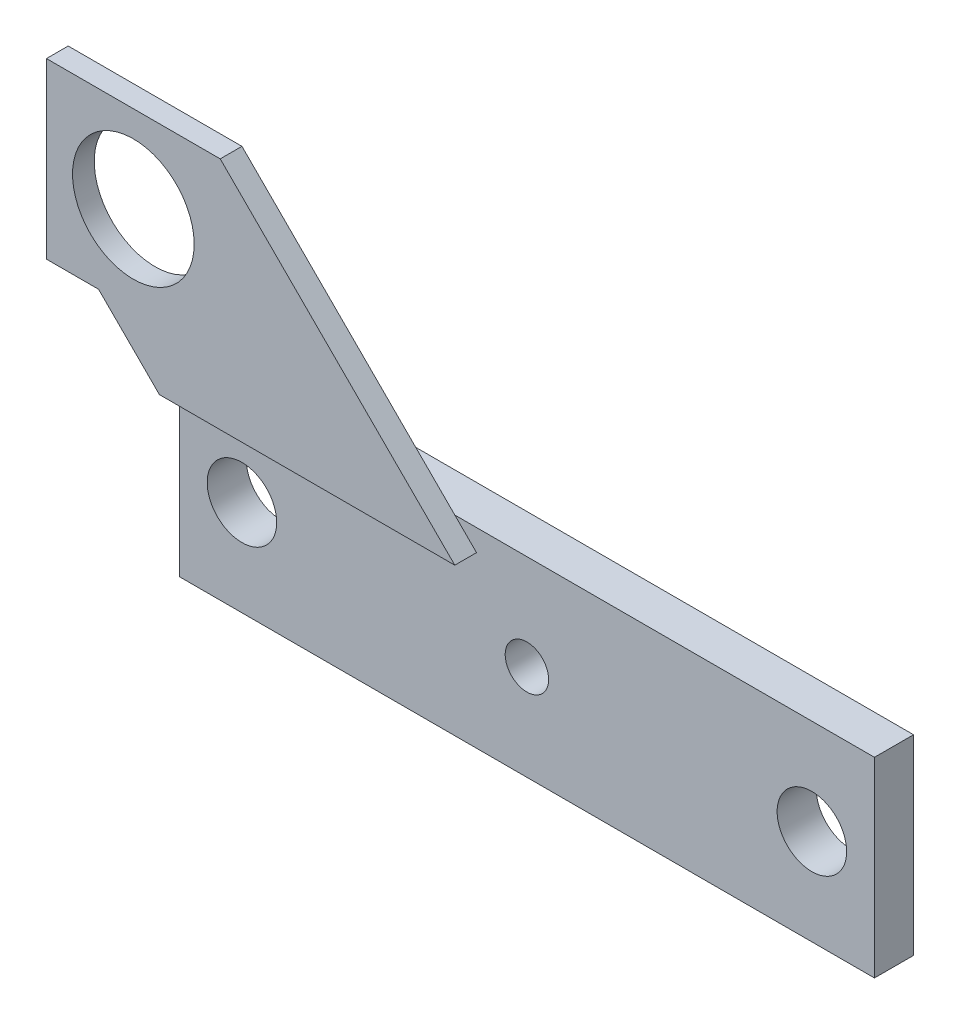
ISO-10303-21;
HEADER;
FILE_DESCRIPTION(('STEP AP214'),'2;1');
FILE_NAME('part.step','',(''),(''),'','','');
FILE_SCHEMA(('AUTOMOTIVE_DESIGN { 1 0 10303 214 1 1 1 1 }'));
ENDSEC;
DATA;
#1=APPLICATION_CONTEXT('core data for automotive mechanical design processes');
#2=APPLICATION_PROTOCOL_DEFINITION('international standard','automotive_design',2000,#1);
#3=PRODUCT_CONTEXT('',#1,'mechanical');
#4=PRODUCT('Part','Part','',(#3));
#5=PRODUCT_RELATED_PRODUCT_CATEGORY('part','',(#4));
#6=PRODUCT_DEFINITION_FORMATION('','',#4);
#7=PRODUCT_DEFINITION_CONTEXT('part definition',#1,'design');
#8=PRODUCT_DEFINITION('design','',#6,#7);
#9=PRODUCT_DEFINITION_SHAPE('','',#8);
#10=(LENGTH_UNIT() NAMED_UNIT(*) SI_UNIT(.MILLI.,.METRE.));
#11=(NAMED_UNIT(*) PLANE_ANGLE_UNIT() SI_UNIT($,.RADIAN.));
#12=(NAMED_UNIT(*) SI_UNIT($,.STERADIAN.) SOLID_ANGLE_UNIT());
#13=UNCERTAINTY_MEASURE_WITH_UNIT(LENGTH_MEASURE(1.E-05),#10,'distance_accuracy_value','');
#14=(GEOMETRIC_REPRESENTATION_CONTEXT(3) GLOBAL_UNCERTAINTY_ASSIGNED_CONTEXT((#13)) GLOBAL_UNIT_ASSIGNED_CONTEXT((#10,
#11,#12)) REPRESENTATION_CONTEXT('',''));
#15=CARTESIAN_POINT('',(0.,0.,0.));
#16=DIRECTION('',(0.,0.,1.));
#17=DIRECTION('',(1.,0.,0.));
#18=AXIS2_PLACEMENT_3D('',#15,#16,#17);
#19=CARTESIAN_POINT('',(21.3892111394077,-12.75,-2.25));
#20=DIRECTION('',(0.,0.,-1.));
#21=DIRECTION('',(-0.201287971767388,-0.979532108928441,0.));
#22=AXIS2_PLACEMENT_3D('',#19,#20,#21);
#23=PLANE('',#22);
#24=DIRECTION('',(-1.,0.,0.));
#25=VECTOR('',#24,1.);
#26=CARTESIAN_POINT('',(1.40000000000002,-18.25,-2.25));
#27=LINE('',#26,#25);
#28=CARTESIAN_POINT('',(41.4,-18.25,-2.25000000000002));
#29=VERTEX_POINT('',#28);
#30=CARTESIAN_POINT('',(1.40000000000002,-18.25,-2.25));
#31=VERTEX_POINT('',#30);
#32=EDGE_CURVE('E119',#29,#31,#27,.T.);
#33=ORIENTED_EDGE('',*,*,#32,.T.);
#34=DIRECTION('',(0.,1.,0.));
#35=VECTOR('',#34,1.);
#36=CARTESIAN_POINT('',(1.40000000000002,-7.24999999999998,-2.25));
#37=LINE('',#36,#35);
#38=CARTESIAN_POINT('',(1.40000000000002,-7.24999999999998,-2.25000000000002));
#39=VERTEX_POINT('',#38);
#40=EDGE_CURVE('E130',#31,#39,#37,.T.);
#41=ORIENTED_EDGE('',*,*,#40,.T.);
#42=DIRECTION('',(1.,0.,0.));
#43=VECTOR('',#42,1.);
#44=CARTESIAN_POINT('',(1.40000000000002,-7.24999999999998,-2.25));
#45=LINE('',#44,#43);
#46=CARTESIAN_POINT('',(41.4,-7.24999999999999,-2.25000000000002));
#47=VERTEX_POINT('',#46);
#48=EDGE_CURVE('E137',#39,#47,#45,.T.);
#49=ORIENTED_EDGE('',*,*,#48,.T.);
#50=DIRECTION('',(0.,-1.,0.));
#51=VECTOR('',#50,1.);
#52=CARTESIAN_POINT('',(41.4,-7.24999999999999,-2.25));
#53=LINE('',#52,#51);
#54=EDGE_CURVE('E140',#47,#29,#53,.T.);
#55=ORIENTED_EDGE('',*,*,#54,.T.);
#56=EDGE_LOOP('',(#33,#41,#49,#55));
#57=FACE_BOUND('',#56,.T.);
#58=CARTESIAN_POINT('',(5.00000000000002,-12.75,-2.25));
#59=DIRECTION('',(0.,0.,-1.));
#60=DIRECTION('',(-1.,0.,0.));
#61=AXIS2_PLACEMENT_3D('',#58,#59,#60);
#62=CIRCLE('',#61,2.);
#63=CARTESIAN_POINT('',(7.00000000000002,-12.75,-2.25000000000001));
#64=VERTEX_POINT('',#63);
#65=EDGE_CURVE('E141',#64,#64,#62,.T.);
#66=ORIENTED_EDGE('',*,*,#65,.F.);
#67=EDGE_LOOP('',(#66));
#68=FACE_BOUND('',#67,.T.);
#69=CARTESIAN_POINT('',(37.8,-12.75,-2.25));
#70=DIRECTION('',(0.,0.,-1.));
#71=DIRECTION('',(-1.,0.,0.));
#72=AXIS2_PLACEMENT_3D('',#69,#70,#71);
#73=CIRCLE('',#72,2.);
#74=CARTESIAN_POINT('',(39.8,-12.75,-2.25000000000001));
#75=VERTEX_POINT('',#74);
#76=EDGE_CURVE('E145',#75,#75,#73,.T.);
#77=ORIENTED_EDGE('',*,*,#76,.F.);
#78=EDGE_LOOP('',(#77));
#79=FACE_BOUND('',#78,.T.);
#80=CARTESIAN_POINT('',(21.4,-12.75,-2.25));
#81=DIRECTION('',(0.,0.,-1.));
#82=DIRECTION('',(-1.,0.,0.));
#83=AXIS2_PLACEMENT_3D('',#80,#81,#82);
#84=CIRCLE('',#83,3.25000000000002);
#85=CARTESIAN_POINT('',(18.15,-12.75,-2.25));
#86=VERTEX_POINT('',#85);
#87=EDGE_CURVE('E408',#86,#86,#84,.T.);
#88=ORIENTED_EDGE('',*,*,#87,.F.);
#89=EDGE_LOOP('',(#88));
#90=FACE_BOUND('',#89,.T.);
#91=ADVANCED_FACE('F32',(#57,#68,#79,#90),#23,.T.);
#92=CARTESIAN_POINT('',(-5.,-5.,1.25));
#93=DIRECTION('',(0.,0.,-1.));
#94=DIRECTION('',(-1.,0.,0.));
#95=AXIS2_PLACEMENT_3D('',#92,#93,#94);
#96=PLANE('',#95);
#97=DIRECTION('',(0.,-1.,0.));
#98=VECTOR('',#97,1.);
#99=CARTESIAN_POINT('',(-5.,5.,1.25));
#100=LINE('',#99,#98);
#101=CARTESIAN_POINT('',(-5.,5.,1.25));
#102=VERTEX_POINT('',#101);
#103=CARTESIAN_POINT('',(-5.,-5.,1.25));
#104=VERTEX_POINT('',#103);
#105=EDGE_CURVE('E179',#102,#104,#100,.T.);
#106=ORIENTED_EDGE('',*,*,#105,.T.);
#107=DIRECTION('',(1.,0.,0.));
#108=VECTOR('',#107,1.);
#109=CARTESIAN_POINT('',(-1.9999999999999,-5.,1.25));
#110=LINE('',#109,#108);
#111=CARTESIAN_POINT('',(-1.9999999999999,-5.,1.25));
#112=VERTEX_POINT('',#111);
#113=EDGE_CURVE('E182',#104,#112,#110,.T.);
#114=ORIENTED_EDGE('',*,*,#113,.T.);
#115=DIRECTION('',(0.707106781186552,-0.707106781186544,0.));
#116=VECTOR('',#115,1.);
#117=CARTESIAN_POINT('',(1.50000000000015,-8.5,1.25));
#118=LINE('',#117,#116);
#119=CARTESIAN_POINT('',(1.50000000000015,-8.5,1.25));
#120=VERTEX_POINT('',#119);
#121=EDGE_CURVE('E185',#112,#120,#118,.T.);
#122=ORIENTED_EDGE('',*,*,#121,.T.);
#123=DIRECTION('',(1.,0.,0.));
#124=VECTOR('',#123,1.);
#125=CARTESIAN_POINT('',(18.5000000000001,-8.5,1.25));
#126=LINE('',#125,#124);
#127=CARTESIAN_POINT('',(18.5000000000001,-8.5,1.25));
#128=VERTEX_POINT('',#127);
#129=EDGE_CURVE('E187',#120,#128,#126,.T.);
#130=ORIENTED_EDGE('',*,*,#129,.T.);
#131=DIRECTION('',(-0.707106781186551,0.707106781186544,0.));
#132=VECTOR('',#131,1.);
#133=CARTESIAN_POINT('',(5.,5.,1.25));
#134=LINE('',#133,#132);
#135=CARTESIAN_POINT('',(5.,5.,1.25));
#136=VERTEX_POINT('',#135);
#137=EDGE_CURVE('E189',#128,#136,#134,.T.);
#138=ORIENTED_EDGE('',*,*,#137,.T.);
#139=DIRECTION('',(-1.,0.,0.));
#140=VECTOR('',#139,1.);
#141=CARTESIAN_POINT('',(-5.,5.,1.25));
#142=LINE('',#141,#140);
#143=EDGE_CURVE('E191',#136,#102,#142,.T.);
#144=ORIENTED_EDGE('',*,*,#143,.T.);
#145=EDGE_LOOP('',(#106,#114,#122,#130,#138,#144));
#146=FACE_BOUND('',#145,.T.);
#147=CARTESIAN_POINT('',(0.,0.,1.25));
#148=DIRECTION('',(0.,0.,1.));
#149=DIRECTION('',(1.,0.,0.));
#150=AXIS2_PLACEMENT_3D('',#147,#148,#149);
#151=CIRCLE('',#150,3.5);
#152=CARTESIAN_POINT('',(3.5,0.,1.25));
#153=VERTEX_POINT('',#152);
#154=EDGE_CURVE('E173',#153,#153,#151,.T.);
#155=ORIENTED_EDGE('',*,*,#154,.F.);
#156=EDGE_LOOP('',(#155));
#157=FACE_BOUND('',#156,.T.);
#158=ADVANCED_FACE('F256',(#146,#157),#96,.F.);
#159=CARTESIAN_POINT('',(-5.,-5.,0.));
#160=DIRECTION('',(0.,0.,-1.));
#161=DIRECTION('',(-1.,0.,0.));
#162=AXIS2_PLACEMENT_3D('',#159,#160,#161);
#163=PLANE('',#162);
#164=DIRECTION('',(0.,1.,0.));
#165=VECTOR('',#164,1.);
#166=CARTESIAN_POINT('',(1.40000000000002,-7.24999999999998,0.));
#167=LINE('',#166,#165);
#168=CARTESIAN_POINT('',(1.40000000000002,-8.39999999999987,0.));
#169=VERTEX_POINT('',#168);
#170=CARTESIAN_POINT('',(1.40000000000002,-7.24999999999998,0.));
#171=VERTEX_POINT('',#170);
#172=EDGE_CURVE('E12',#169,#171,#167,.T.);
#173=ORIENTED_EDGE('',*,*,#172,.F.);
#174=DIRECTION('',(0.707106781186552,-0.707106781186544,0.));
#175=VECTOR('',#174,1.);
#176=CARTESIAN_POINT('',(1.50000000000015,-8.5,0.));
#177=LINE('',#176,#175);
#178=CARTESIAN_POINT('',(-1.9999999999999,-5.,0.));
#179=VERTEX_POINT('',#178);
#180=EDGE_CURVE('E199',#179,#169,#177,.T.);
#181=ORIENTED_EDGE('',*,*,#180,.F.);
#182=DIRECTION('',(1.,0.,0.));
#183=VECTOR('',#182,1.);
#184=CARTESIAN_POINT('',(-1.9999999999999,-5.,0.));
#185=LINE('',#184,#183);
#186=CARTESIAN_POINT('',(-5.,-5.,0.));
#187=VERTEX_POINT('',#186);
#188=EDGE_CURVE('E196',#187,#179,#185,.T.);
#189=ORIENTED_EDGE('',*,*,#188,.F.);
#190=DIRECTION('',(0.,-1.,0.));
#191=VECTOR('',#190,1.);
#192=CARTESIAN_POINT('',(-5.,5.,0.));
#193=LINE('',#192,#191);
#194=CARTESIAN_POINT('',(-5.,5.,0.));
#195=VERTEX_POINT('',#194);
#196=EDGE_CURVE('E176',#195,#187,#193,.T.);
#197=ORIENTED_EDGE('',*,*,#196,.F.);
#198=DIRECTION('',(-1.,0.,0.));
#199=VECTOR('',#198,1.);
#200=CARTESIAN_POINT('',(-5.,5.,0.));
#201=LINE('',#200,#199);
#202=CARTESIAN_POINT('',(5.,5.,0.));
#203=VERTEX_POINT('',#202);
#204=EDGE_CURVE('E183',#203,#195,#201,.T.);
#205=ORIENTED_EDGE('',*,*,#204,.F.);
#206=DIRECTION('',(-0.707106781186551,0.707106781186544,0.));
#207=VECTOR('',#206,1.);
#208=CARTESIAN_POINT('',(5.,5.,0.));
#209=LINE('',#208,#207);
#210=CARTESIAN_POINT('',(17.2500000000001,-7.24999999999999,0.));
#211=VERTEX_POINT('',#210);
#212=EDGE_CURVE('E203',#211,#203,#209,.T.);
#213=ORIENTED_EDGE('',*,*,#212,.F.);
#214=DIRECTION('',(1.,0.,0.));
#215=VECTOR('',#214,1.);
#216=CARTESIAN_POINT('',(1.40000000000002,-7.24999999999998,0.));
#217=LINE('',#216,#215);
#218=EDGE_CURVE('E49',#171,#211,#217,.T.);
#219=ORIENTED_EDGE('',*,*,#218,.F.);
#220=EDGE_LOOP('',(#173,#181,#189,#197,#205,#213,#219));
#221=FACE_BOUND('',#220,.T.);
#222=CARTESIAN_POINT('',(0.,0.,0.));
#223=DIRECTION('',(0.,0.,1.));
#224=DIRECTION('',(1.,0.,0.));
#225=AXIS2_PLACEMENT_3D('',#222,#223,#224);
#226=CIRCLE('',#225,3.5);
#227=CARTESIAN_POINT('',(3.5,0.,0.));
#228=VERTEX_POINT('',#227);
#229=EDGE_CURVE('E169',#228,#228,#226,.T.);
#230=ORIENTED_EDGE('',*,*,#229,.T.);
#231=EDGE_LOOP('',(#230));
#232=FACE_BOUND('',#231,.T.);
#233=ADVANCED_FACE('F231',(#221,#232),#163,.T.);
#234=CARTESIAN_POINT('',(-5.,5.,1.25));
#235=DIRECTION('',(1.,0.,0.));
#236=DIRECTION('',(0.,0.,-1.));
#237=AXIS2_PLACEMENT_3D('',#234,#235,#236);
#238=PLANE('',#237);
#239=ORIENTED_EDGE('',*,*,#196,.T.);
#240=DIRECTION('',(0.,0.,-1.));
#241=VECTOR('',#240,1.);
#242=CARTESIAN_POINT('',(-5.,-5.,1.25));
#243=LINE('',#242,#241);
#244=EDGE_CURVE('E36',#104,#187,#243,.T.);
#245=ORIENTED_EDGE('',*,*,#244,.F.);
#246=ORIENTED_EDGE('',*,*,#105,.F.);
#247=DIRECTION('',(0.,0.,-1.));
#248=VECTOR('',#247,1.);
#249=CARTESIAN_POINT('',(-5.,5.,1.25));
#250=LINE('',#249,#248);
#251=EDGE_CURVE('E193',#102,#195,#250,.T.);
#252=ORIENTED_EDGE('',*,*,#251,.T.);
#253=EDGE_LOOP('',(#239,#245,#246,#252));
#254=FACE_BOUND('',#253,.T.);
#255=ADVANCED_FACE('F34',(#254),#238,.F.);
#256=CARTESIAN_POINT('',(-1.9999999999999,-5.,1.25));
#257=DIRECTION('',(0.,1.,0.));
#258=DIRECTION('',(-1.,0.,0.));
#259=AXIS2_PLACEMENT_3D('',#256,#257,#258);
#260=PLANE('',#259);
#261=ORIENTED_EDGE('',*,*,#188,.T.);
#262=DIRECTION('',(0.,0.,-1.));
#263=VECTOR('',#262,1.);
#264=CARTESIAN_POINT('',(-1.9999999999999,-5.,1.25));
#265=LINE('',#264,#263);
#266=EDGE_CURVE('E217',#112,#179,#265,.T.);
#267=ORIENTED_EDGE('',*,*,#266,.F.);
#268=ORIENTED_EDGE('',*,*,#113,.F.);
#269=ORIENTED_EDGE('',*,*,#244,.T.);
#270=EDGE_LOOP('',(#261,#267,#268,#269));
#271=FACE_BOUND('',#270,.T.);
#272=ADVANCED_FACE('F225',(#271),#260,.F.);
#273=CARTESIAN_POINT('',(1.50000000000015,-8.5,1.25));
#274=DIRECTION('',(0.707106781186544,0.707106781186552,0.));
#275=DIRECTION('',(-0.707106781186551,0.707106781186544,0.));
#276=AXIS2_PLACEMENT_3D('',#273,#274,#275);
#277=PLANE('',#276);
#278=ORIENTED_EDGE('',*,*,#180,.T.);
#279=CARTESIAN_POINT('',(1.50000000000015,-8.5,0.));
#280=VERTEX_POINT('',#279);
#281=EDGE_CURVE('E198',#169,#280,#177,.T.);
#282=ORIENTED_EDGE('',*,*,#281,.T.);
#283=DIRECTION('',(0.,0.,-1.));
#284=VECTOR('',#283,1.);
#285=CARTESIAN_POINT('',(1.50000000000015,-8.5,1.25));
#286=LINE('',#285,#284);
#287=EDGE_CURVE('E215',#120,#280,#286,.T.);
#288=ORIENTED_EDGE('',*,*,#287,.F.);
#289=ORIENTED_EDGE('',*,*,#121,.F.);
#290=ORIENTED_EDGE('',*,*,#266,.T.);
#291=EDGE_LOOP('',(#278,#282,#288,#289,#290));
#292=FACE_BOUND('',#291,.T.);
#293=ADVANCED_FACE('F234',(#292),#277,.F.);
#294=CARTESIAN_POINT('',(18.5000000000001,-8.5,1.25));
#295=DIRECTION('',(0.,1.,0.));
#296=DIRECTION('',(-1.,0.,0.));
#297=AXIS2_PLACEMENT_3D('',#294,#295,#296);
#298=PLANE('',#297);
#299=DIRECTION('',(1.,0.,0.));
#300=VECTOR('',#299,1.);
#301=CARTESIAN_POINT('',(18.5000000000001,-8.5,0.));
#302=LINE('',#301,#300);
#303=CARTESIAN_POINT('',(18.5000000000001,-8.5,0.));
#304=VERTEX_POINT('',#303);
#305=EDGE_CURVE('E201',#280,#304,#302,.T.);
#306=ORIENTED_EDGE('',*,*,#305,.T.);
#307=DIRECTION('',(0.,0.,-1.));
#308=VECTOR('',#307,1.);
#309=CARTESIAN_POINT('',(18.5000000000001,-8.5,1.25));
#310=LINE('',#309,#308);
#311=EDGE_CURVE('E212',#128,#304,#310,.T.);
#312=ORIENTED_EDGE('',*,*,#311,.F.);
#313=ORIENTED_EDGE('',*,*,#129,.F.);
#314=ORIENTED_EDGE('',*,*,#287,.T.);
#315=EDGE_LOOP('',(#306,#312,#313,#314));
#316=FACE_BOUND('',#315,.T.);
#317=ADVANCED_FACE('F254',(#316),#298,.F.);
#318=CARTESIAN_POINT('',(5.,5.,1.25));
#319=DIRECTION('',(-0.707106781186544,-0.707106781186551,0.));
#320=DIRECTION('',(0.707106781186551,-0.707106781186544,0.));
#321=AXIS2_PLACEMENT_3D('',#318,#319,#320);
#322=PLANE('',#321);
#323=EDGE_CURVE('E204',#304,#211,#209,.T.);
#324=ORIENTED_EDGE('',*,*,#323,.T.);
#325=ORIENTED_EDGE('',*,*,#212,.T.);
#326=DIRECTION('',(0.,0.,-1.));
#327=VECTOR('',#326,1.);
#328=CARTESIAN_POINT('',(5.,5.,1.25));
#329=LINE('',#328,#327);
#330=EDGE_CURVE('E209',#136,#203,#329,.T.);
#331=ORIENTED_EDGE('',*,*,#330,.F.);
#332=ORIENTED_EDGE('',*,*,#137,.F.);
#333=ORIENTED_EDGE('',*,*,#311,.T.);
#334=EDGE_LOOP('',(#324,#325,#331,#332,#333));
#335=FACE_BOUND('',#334,.T.);
#336=ADVANCED_FACE('F248',(#335),#322,.F.);
#337=CARTESIAN_POINT('',(-5.,5.,1.25));
#338=DIRECTION('',(0.,-1.,0.));
#339=DIRECTION('',(0.,0.,-1.));
#340=AXIS2_PLACEMENT_3D('',#337,#338,#339);
#341=PLANE('',#340);
#342=ORIENTED_EDGE('',*,*,#204,.T.);
#343=ORIENTED_EDGE('',*,*,#251,.F.);
#344=ORIENTED_EDGE('',*,*,#143,.F.);
#345=ORIENTED_EDGE('',*,*,#330,.T.);
#346=EDGE_LOOP('',(#342,#343,#344,#345));
#347=FACE_BOUND('',#346,.T.);
#348=ADVANCED_FACE('F260',(#347),#341,.F.);
#349=CARTESIAN_POINT('',(0.,0.,1.25));
#350=DIRECTION('',(0.,0.,-1.));
#351=DIRECTION('',(-1.,0.,0.));
#352=AXIS2_PLACEMENT_3D('',#349,#350,#351);
#353=CYLINDRICAL_SURFACE('',#352,3.5);
#354=ORIENTED_EDGE('',*,*,#154,.T.);
#355=EDGE_LOOP('',(#354));
#356=FACE_BOUND('',#355,.T.);
#357=ORIENTED_EDGE('',*,*,#229,.F.);
#358=EDGE_LOOP('',(#357));
#359=FACE_BOUND('',#358,.T.);
#360=ADVANCED_FACE('F262',(#356,#359),#353,.F.);
#361=CARTESIAN_POINT('',(1.40000000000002,-18.25,0.));
#362=DIRECTION('',(0.,0.,1.));
#363=DIRECTION('',(1.,0.,0.));
#364=AXIS2_PLACEMENT_3D('',#361,#362,#363);
#365=PLANE('',#364);
#366=CARTESIAN_POINT('',(37.8,-12.75,0.));
#367=DIRECTION('',(0.,0.,-1.));
#368=DIRECTION('',(-1.,0.,0.));
#369=AXIS2_PLACEMENT_3D('',#366,#367,#368);
#370=CIRCLE('',#369,2.);
#371=CARTESIAN_POINT('',(39.8,-12.75,0.));
#372=VERTEX_POINT('',#371);
#373=EDGE_CURVE('E136',#372,#372,#370,.T.);
#374=ORIENTED_EDGE('',*,*,#373,.T.);
#375=EDGE_LOOP('',(#374));
#376=FACE_BOUND('',#375,.T.);
#377=CARTESIAN_POINT('',(21.4,-12.75,0.));
#378=DIRECTION('',(0.,0.,-1.));
#379=DIRECTION('',(-1.,0.,0.));
#380=AXIS2_PLACEMENT_3D('',#377,#378,#379);
#381=CIRCLE('',#380,1.25000000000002);
#382=CARTESIAN_POINT('',(22.65,-12.75,0.));
#383=VERTEX_POINT('',#382);
#384=EDGE_CURVE('E155',#383,#383,#381,.T.);
#385=ORIENTED_EDGE('',*,*,#384,.T.);
#386=EDGE_LOOP('',(#385));
#387=FACE_BOUND('',#386,.T.);
#388=CARTESIAN_POINT('',(5.00000000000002,-12.75,0.));
#389=DIRECTION('',(0.,0.,-1.));
#390=DIRECTION('',(-1.,0.,0.));
#391=AXIS2_PLACEMENT_3D('',#388,#389,#390);
#392=CIRCLE('',#391,2.);
#393=CARTESIAN_POINT('',(7.00000000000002,-12.75,0.));
#394=VERTEX_POINT('',#393);
#395=EDGE_CURVE('E152',#394,#394,#392,.T.);
#396=ORIENTED_EDGE('',*,*,#395,.T.);
#397=EDGE_LOOP('',(#396));
#398=FACE_BOUND('',#397,.T.);
#399=ORIENTED_EDGE('',*,*,#323,.F.);
#400=ORIENTED_EDGE('',*,*,#305,.F.);
#401=ORIENTED_EDGE('',*,*,#281,.F.);
#402=CARTESIAN_POINT('',(1.40000000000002,-18.25,0.));
#403=VERTEX_POINT('',#402);
#404=EDGE_CURVE('E42',#403,#169,#167,.T.);
#405=ORIENTED_EDGE('',*,*,#404,.F.);
#406=DIRECTION('',(-1.,0.,0.));
#407=VECTOR('',#406,1.);
#408=CARTESIAN_POINT('',(1.40000000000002,-18.25,0.));
#409=LINE('',#408,#407);
#410=CARTESIAN_POINT('',(41.4,-18.25,0.));
#411=VERTEX_POINT('',#410);
#412=EDGE_CURVE('E122',#411,#403,#409,.T.);
#413=ORIENTED_EDGE('',*,*,#412,.F.);
#414=DIRECTION('',(0.,-1.,0.));
#415=VECTOR('',#414,1.);
#416=CARTESIAN_POINT('',(41.4,-7.24999999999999,0.));
#417=LINE('',#416,#415);
#418=CARTESIAN_POINT('',(41.4,-7.24999999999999,0.));
#419=VERTEX_POINT('',#418);
#420=EDGE_CURVE('E160',#419,#411,#417,.T.);
#421=ORIENTED_EDGE('',*,*,#420,.F.);
#422=EDGE_CURVE('E158',#211,#419,#217,.T.);
#423=ORIENTED_EDGE('',*,*,#422,.F.);
#424=EDGE_LOOP('',(#399,#400,#401,#405,#413,#421,#423));
#425=FACE_BOUND('',#424,.T.);
#426=ADVANCED_FACE('F239',(#376,#387,#398,#425),#365,.T.);
#427=CARTESIAN_POINT('',(21.4,-12.75,-45.7349370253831));
#428=DIRECTION('',(0.,0.,1.));
#429=DIRECTION('',(1.,0.,0.));
#430=AXIS2_PLACEMENT_3D('',#427,#428,#429);
#431=CYLINDRICAL_SURFACE('',#430,1.25000000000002);
#432=CARTESIAN_POINT('',(21.4,-12.75,-4.25));
#433=DIRECTION('',(0.,0.,-1.));
#434=DIRECTION('',(-1.,0.,0.));
#435=AXIS2_PLACEMENT_3D('',#432,#433,#434);
#436=CIRCLE('',#435,1.25000000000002);
#437=CARTESIAN_POINT('',(22.65,-12.75,-4.25));
#438=VERTEX_POINT('',#437);
#439=EDGE_CURVE('E404',#438,#438,#436,.T.);
#440=CARTESIAN_POINT('',(22.65,-12.75,0.));
#441=CARTESIAN_POINT('',(22.65,-12.75,-0.0442708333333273));
#442=CARTESIAN_POINT('',(22.65,-12.75,-0.0885416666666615));
#443=CARTESIAN_POINT('',(22.65,-12.75,-0.177083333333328));
#444=CARTESIAN_POINT('',(22.65,-12.75,-0.22135416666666));
#445=CARTESIAN_POINT('',(22.65,-12.75,-0.309895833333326));
#446=CARTESIAN_POINT('',(22.65,-12.75,-0.35416666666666));
#447=CARTESIAN_POINT('',(22.65,-12.75,-0.442708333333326));
#448=CARTESIAN_POINT('',(22.65,-12.75,-0.486979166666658));
#449=CARTESIAN_POINT('',(22.65,-12.75,-0.575520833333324));
#450=CARTESIAN_POINT('',(22.65,-12.75,-0.619791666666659));
#451=CARTESIAN_POINT('',(22.65,-12.75,-0.708333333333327));
#452=CARTESIAN_POINT('',(22.65,-12.75,-0.752604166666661));
#453=CARTESIAN_POINT('',(22.65,-12.75,-0.841145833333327));
#454=CARTESIAN_POINT('',(22.65,-12.75,-0.885416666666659));
#455=CARTESIAN_POINT('',(22.65,-12.75,-0.973958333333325));
#456=CARTESIAN_POINT('',(22.65,-12.75,-1.01822916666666));
#457=CARTESIAN_POINT('',(22.65,-12.75,-1.10677083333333));
#458=CARTESIAN_POINT('',(22.65,-12.75,-1.15104166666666));
#459=CARTESIAN_POINT('',(22.65,-12.75,-1.23958333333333));
#460=CARTESIAN_POINT('',(22.65,-12.75,-1.28385416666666));
#461=CARTESIAN_POINT('',(22.65,-12.75,-1.37239583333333));
#462=CARTESIAN_POINT('',(22.65,-12.75,-1.41666666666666));
#463=CARTESIAN_POINT('',(22.65,-12.75,-1.50520833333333));
#464=CARTESIAN_POINT('',(22.65,-12.75,-1.54947916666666));
#465=CARTESIAN_POINT('',(22.65,-12.75,-1.63802083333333));
#466=CARTESIAN_POINT('',(22.65,-12.75,-1.68229166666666));
#467=CARTESIAN_POINT('',(22.65,-12.75,-1.77083333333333));
#468=CARTESIAN_POINT('',(22.65,-12.75,-1.81510416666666));
#469=CARTESIAN_POINT('',(22.65,-12.75,-1.90364583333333));
#470=CARTESIAN_POINT('',(22.65,-12.75,-1.94791666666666));
#471=CARTESIAN_POINT('',(22.65,-12.75,-2.03645833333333));
#472=CARTESIAN_POINT('',(22.65,-12.75,-2.08072916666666));
#473=CARTESIAN_POINT('',(22.65,-12.75,-2.16927083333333));
#474=CARTESIAN_POINT('',(22.65,-12.75,-2.21354166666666));
#475=CARTESIAN_POINT('',(22.65,-12.75,-2.30208333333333));
#476=CARTESIAN_POINT('',(22.65,-12.75,-2.34635416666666));
#477=CARTESIAN_POINT('',(22.65,-12.75,-2.43489583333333));
#478=CARTESIAN_POINT('',(22.65,-12.75,-2.47916666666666));
#479=CARTESIAN_POINT('',(22.65,-12.75,-2.56770833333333));
#480=CARTESIAN_POINT('',(22.65,-12.75,-2.61197916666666));
#481=CARTESIAN_POINT('',(22.65,-12.75,-2.70052083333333));
#482=CARTESIAN_POINT('',(22.65,-12.75,-2.74479166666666));
#483=CARTESIAN_POINT('',(22.65,-12.75,-2.83333333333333));
#484=CARTESIAN_POINT('',(22.65,-12.75,-2.87760416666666));
#485=CARTESIAN_POINT('',(22.65,-12.75,-2.96614583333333));
#486=CARTESIAN_POINT('',(22.65,-12.75,-3.01041666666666));
#487=CARTESIAN_POINT('',(22.65,-12.75,-3.09895833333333));
#488=CARTESIAN_POINT('',(22.65,-12.75,-3.14322916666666));
#489=CARTESIAN_POINT('',(22.65,-12.75,-3.23177083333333));
#490=CARTESIAN_POINT('',(22.65,-12.75,-3.27604166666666));
#491=CARTESIAN_POINT('',(22.65,-12.75,-3.36458333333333));
#492=CARTESIAN_POINT('',(22.65,-12.75,-3.40885416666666));
#493=CARTESIAN_POINT('',(22.65,-12.75,-3.49739583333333));
#494=CARTESIAN_POINT('',(22.65,-12.75,-3.54166666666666));
#495=CARTESIAN_POINT('',(22.65,-12.75,-3.63020833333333));
#496=CARTESIAN_POINT('',(22.65,-12.75,-3.67447916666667));
#497=CARTESIAN_POINT('',(22.65,-12.75,-3.76302083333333));
#498=CARTESIAN_POINT('',(22.65,-12.75,-3.80729166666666));
#499=CARTESIAN_POINT('',(22.65,-12.75,-3.89583333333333));
#500=CARTESIAN_POINT('',(22.65,-12.75,-3.94010416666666));
#501=CARTESIAN_POINT('',(22.65,-12.75,-4.02864583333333));
#502=CARTESIAN_POINT('',(22.65,-12.75,-4.07291666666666));
#503=CARTESIAN_POINT('',(22.65,-12.75,-4.16145833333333));
#504=CARTESIAN_POINT('',(22.65,-12.75,-4.20572916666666));
#505=CARTESIAN_POINT('',(22.65,-12.75,-4.25));
#506=B_SPLINE_CURVE_WITH_KNOTS('',3,(#440,#441,#442,#443,#444,#445,#446,#447,#448,#449,#450,
#451,#452,#453,#454,#455,#456,#457,#458,#459,#460,#461,#462,#463,#464,#465,#466,#467,#468,#469,
#470,#471,#472,#473,#474,#475,#476,#477,#478,#479,#480,#481,#482,#483,#484,#485,#486,#487,#488,
#489,#490,#491,#492,#493,#494,#495,#496,#497,#498,#499,#500,#501,#502,#503,#504,#505),
.UNSPECIFIED.,.F.,.F.,(4,2,2,2,2,2,2,2,2,2,2,2,2,2,2,2,2,2,2,2,2,2,2,2,2,2,2,2,2,2,2,2,4),(0.,
0.132812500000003,0.265624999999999,0.398437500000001,0.531249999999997,0.6640625,
0.796875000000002,0.929687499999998,1.0625,1.1953125,1.328125,1.4609375,1.59375,1.7265625,
1.859375,1.9921875,2.125,2.2578125,2.390625,2.5234375,2.65625,2.7890625,2.921875,3.0546875,
3.1875,3.32031250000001,3.453125,3.5859375,3.71875000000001,3.8515625,3.98437500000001,
4.1171875,4.25),.UNSPECIFIED.);
#507=EDGE_CURVE('BSEAM290',#383,#438,#506,.T.);
#508=ORIENTED_EDGE('',*,*,#384,.F.);
#509=ORIENTED_EDGE('',*,*,#439,.T.);
#510=ORIENTED_EDGE('',*,*,#507,.T.);
#511=ORIENTED_EDGE('',*,*,#507,.F.);
#512=EDGE_LOOP('',(#508,#510,#509,#511));
#513=FACE_BOUND('',#512,.T.);
#514=ADVANCED_FACE('F290',(#513),#431,.F.);
#515=CARTESIAN_POINT('',(1.40000000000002,-18.25,-45.7349370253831));
#516=DIRECTION('',(0.,1.,0.));
#517=DIRECTION('',(0.,0.,1.));
#518=AXIS2_PLACEMENT_3D('',#515,#516,#517);
#519=PLANE('',#518);
#520=ORIENTED_EDGE('',*,*,#32,.F.);
#521=DIRECTION('',(0.,0.,1.));
#522=VECTOR('',#521,1.);
#523=CARTESIAN_POINT('',(41.4,-18.25,-45.7349370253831));
#524=LINE('',#523,#522);
#525=EDGE_CURVE('E126',#29,#411,#524,.T.);
#526=ORIENTED_EDGE('',*,*,#525,.T.);
#527=ORIENTED_EDGE('',*,*,#412,.T.);
#528=DIRECTION('',(0.,0.,1.));
#529=VECTOR('',#528,1.);
#530=CARTESIAN_POINT('',(1.40000000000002,-18.25,-45.7349370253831));
#531=LINE('',#530,#529);
#532=EDGE_CURVE('E115',#31,#403,#531,.T.);
#533=ORIENTED_EDGE('',*,*,#532,.F.);
#534=EDGE_LOOP('',(#520,#526,#527,#533));
#535=FACE_BOUND('',#534,.T.);
#536=ADVANCED_FACE('F117',(#535),#519,.F.);
#537=CARTESIAN_POINT('',(41.4,-7.24999999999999,-45.7349370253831));
#538=DIRECTION('',(-1.,0.,0.));
#539=DIRECTION('',(0.,-1.,0.));
#540=AXIS2_PLACEMENT_3D('',#537,#538,#539);
#541=PLANE('',#540);
#542=ORIENTED_EDGE('',*,*,#54,.F.);
#543=DIRECTION('',(0.,0.,1.));
#544=VECTOR('',#543,1.);
#545=CARTESIAN_POINT('',(41.4,-7.24999999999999,-45.7349370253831));
#546=LINE('',#545,#544);
#547=EDGE_CURVE('E165',#47,#419,#546,.T.);
#548=ORIENTED_EDGE('',*,*,#547,.T.);
#549=ORIENTED_EDGE('',*,*,#420,.T.);
#550=ORIENTED_EDGE('',*,*,#525,.F.);
#551=EDGE_LOOP('',(#542,#548,#549,#550));
#552=FACE_BOUND('',#551,.T.);
#553=ADVANCED_FACE('F246',(#552),#541,.F.);
#554=CARTESIAN_POINT('',(1.40000000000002,-7.24999999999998,-45.7349370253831));
#555=DIRECTION('',(0.,-1.,0.));
#556=DIRECTION('',(1.,0.,0.));
#557=AXIS2_PLACEMENT_3D('',#554,#555,#556);
#558=PLANE('',#557);
#559=ORIENTED_EDGE('',*,*,#48,.F.);
#560=DIRECTION('',(0.,0.,1.));
#561=VECTOR('',#560,1.);
#562=CARTESIAN_POINT('',(1.40000000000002,-7.24999999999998,-45.7349370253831));
#563=LINE('',#562,#561);
#564=EDGE_CURVE('E133',#39,#171,#563,.T.);
#565=ORIENTED_EDGE('',*,*,#564,.T.);
#566=ORIENTED_EDGE('',*,*,#218,.T.);
#567=ORIENTED_EDGE('',*,*,#422,.T.);
#568=ORIENTED_EDGE('',*,*,#547,.F.);
#569=EDGE_LOOP('',(#559,#565,#566,#567,#568));
#570=FACE_BOUND('',#569,.T.);
#571=ADVANCED_FACE('F241',(#570),#558,.F.);
#572=CARTESIAN_POINT('',(1.40000000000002,-7.24999999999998,-45.7349370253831));
#573=DIRECTION('',(1.,0.,0.));
#574=DIRECTION('',(0.,1.,0.));
#575=AXIS2_PLACEMENT_3D('',#572,#573,#574);
#576=PLANE('',#575);
#577=ORIENTED_EDGE('',*,*,#40,.F.);
#578=ORIENTED_EDGE('',*,*,#532,.T.);
#579=ORIENTED_EDGE('',*,*,#404,.T.);
#580=ORIENTED_EDGE('',*,*,#172,.T.);
#581=ORIENTED_EDGE('',*,*,#564,.F.);
#582=EDGE_LOOP('',(#577,#578,#579,#580,#581));
#583=FACE_BOUND('',#582,.T.);
#584=ADVANCED_FACE('F131',(#583),#576,.F.);
#585=CARTESIAN_POINT('',(5.00000000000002,-12.75,-45.7349370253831));
#586=DIRECTION('',(0.,0.,1.));
#587=DIRECTION('',(1.,0.,0.));
#588=AXIS2_PLACEMENT_3D('',#585,#586,#587);
#589=CYLINDRICAL_SURFACE('',#588,2.);
#590=CARTESIAN_POINT('',(7.00000000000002,-12.75,0.));
#591=CARTESIAN_POINT('',(7.00000000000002,-12.75,-0.0234374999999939));
#592=CARTESIAN_POINT('',(7.00000000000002,-12.75,-0.0468749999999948));
#593=CARTESIAN_POINT('',(7.00000000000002,-12.75,-0.0937499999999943));
#594=CARTESIAN_POINT('',(7.00000000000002,-12.75,-0.117187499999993));
#595=CARTESIAN_POINT('',(7.00000000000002,-12.75,-0.164062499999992));
#596=CARTESIAN_POINT('',(7.00000000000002,-12.75,-0.187499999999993));
#597=CARTESIAN_POINT('',(7.00000000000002,-12.75,-0.234374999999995));
#598=CARTESIAN_POINT('',(7.00000000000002,-12.75,-0.257812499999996));
#599=CARTESIAN_POINT('',(7.00000000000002,-12.75,-0.304687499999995));
#600=CARTESIAN_POINT('',(7.00000000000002,-12.75,-0.328124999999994));
#601=CARTESIAN_POINT('',(7.00000000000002,-12.75,-0.374999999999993));
#602=CARTESIAN_POINT('',(7.00000000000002,-12.75,-0.398437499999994));
#603=CARTESIAN_POINT('',(7.00000000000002,-12.75,-0.445312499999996));
#604=CARTESIAN_POINT('',(7.00000000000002,-12.75,-0.468749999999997));
#605=CARTESIAN_POINT('',(7.00000000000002,-12.75,-0.515624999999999));
#606=CARTESIAN_POINT('',(7.00000000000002,-12.75,-0.5390625));
#607=CARTESIAN_POINT('',(7.00000000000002,-12.75,-0.585937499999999));
#608=CARTESIAN_POINT('',(7.00000000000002,-12.75,-0.609374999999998));
#609=CARTESIAN_POINT('',(7.00000000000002,-12.75,-0.656249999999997));
#610=CARTESIAN_POINT('',(7.00000000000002,-12.75,-0.679687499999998));
#611=CARTESIAN_POINT('',(7.00000000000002,-12.75,-0.7265625));
#612=CARTESIAN_POINT('',(7.00000000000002,-12.75,-0.750000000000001));
#613=CARTESIAN_POINT('',(7.00000000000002,-12.75,-0.796875));
#614=CARTESIAN_POINT('',(7.00000000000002,-12.75,-0.820312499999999));
#615=CARTESIAN_POINT('',(7.00000000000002,-12.75,-0.867187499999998));
#616=CARTESIAN_POINT('',(7.00000000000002,-12.75,-0.890624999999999));
#617=CARTESIAN_POINT('',(7.00000000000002,-12.75,-0.937500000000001));
#618=CARTESIAN_POINT('',(7.00000000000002,-12.75,-0.960937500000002));
#619=CARTESIAN_POINT('',(7.00000000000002,-12.75,-1.0078125));
#620=CARTESIAN_POINT('',(7.00000000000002,-12.75,-1.03125));
#621=CARTESIAN_POINT('',(7.00000000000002,-12.75,-1.078125));
#622=CARTESIAN_POINT('',(7.00000000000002,-12.75,-1.1015625));
#623=CARTESIAN_POINT('',(7.00000000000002,-12.75,-1.1484375));
#624=CARTESIAN_POINT('',(7.00000000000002,-12.75,-1.171875));
#625=CARTESIAN_POINT('',(7.00000000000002,-12.75,-1.21875));
#626=CARTESIAN_POINT('',(7.00000000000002,-12.75,-1.2421875));
#627=CARTESIAN_POINT('',(7.00000000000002,-12.75,-1.2890625));
#628=CARTESIAN_POINT('',(7.00000000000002,-12.75,-1.3125));
#629=CARTESIAN_POINT('',(7.00000000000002,-12.75,-1.359375));
#630=CARTESIAN_POINT('',(7.00000000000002,-12.75,-1.3828125));
#631=CARTESIAN_POINT('',(7.00000000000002,-12.75,-1.4296875));
#632=CARTESIAN_POINT('',(7.00000000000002,-12.75,-1.453125));
#633=CARTESIAN_POINT('',(7.00000000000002,-12.75,-1.5));
#634=CARTESIAN_POINT('',(7.00000000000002,-12.75,-1.5234375));
#635=CARTESIAN_POINT('',(7.00000000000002,-12.75,-1.5703125));
#636=CARTESIAN_POINT('',(7.00000000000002,-12.75,-1.59375));
#637=CARTESIAN_POINT('',(7.00000000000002,-12.75,-1.640625));
#638=CARTESIAN_POINT('',(7.00000000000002,-12.75,-1.6640625));
#639=CARTESIAN_POINT('',(7.00000000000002,-12.75,-1.7109375));
#640=CARTESIAN_POINT('',(7.00000000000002,-12.75,-1.734375));
#641=CARTESIAN_POINT('',(7.00000000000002,-12.75,-1.78125000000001));
#642=CARTESIAN_POINT('',(7.00000000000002,-12.75,-1.80468750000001));
#643=CARTESIAN_POINT('',(7.00000000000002,-12.75,-1.85156250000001));
#644=CARTESIAN_POINT('',(7.00000000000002,-12.75,-1.87500000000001));
#645=CARTESIAN_POINT('',(7.00000000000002,-12.75,-1.92187500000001));
#646=CARTESIAN_POINT('',(7.00000000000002,-12.75,-1.94531250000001));
#647=CARTESIAN_POINT('',(7.00000000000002,-12.75,-1.99218750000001));
#648=CARTESIAN_POINT('',(7.00000000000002,-12.75,-2.01562500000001));
#649=CARTESIAN_POINT('',(7.00000000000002,-12.75,-2.06250000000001));
#650=CARTESIAN_POINT('',(7.00000000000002,-12.75,-2.08593750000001));
#651=CARTESIAN_POINT('',(7.00000000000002,-12.75,-2.13281250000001));
#652=CARTESIAN_POINT('',(7.00000000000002,-12.75,-2.15625000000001));
#653=CARTESIAN_POINT('',(7.00000000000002,-12.75,-2.20312500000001));
#654=CARTESIAN_POINT('',(7.00000000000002,-12.75,-2.22656250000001));
#655=CARTESIAN_POINT('',(7.00000000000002,-12.75,-2.25000000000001));
#656=B_SPLINE_CURVE_WITH_KNOTS('',3,(#590,#591,#592,#593,#594,#595,#596,#597,#598,#599,#600,
#601,#602,#603,#604,#605,#606,#607,#608,#609,#610,#611,#612,#613,#614,#615,#616,#617,#618,#619,
#620,#621,#622,#623,#624,#625,#626,#627,#628,#629,#630,#631,#632,#633,#634,#635,#636,#637,#638,
#639,#640,#641,#642,#643,#644,#645,#646,#647,#648,#649,#650,#651,#652,#653,#654,#655),
.UNSPECIFIED.,.F.,.F.,(4,2,2,2,2,2,2,2,2,2,2,2,2,2,2,2,2,2,2,2,2,2,2,2,2,2,2,2,2,2,2,2,4),(0.,
0.0703125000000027,0.140624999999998,0.210937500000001,0.281250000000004,0.351562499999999,
0.421875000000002,0.492187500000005,0.562500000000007,0.632812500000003,0.703125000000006,
0.773437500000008,0.843750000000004,0.914062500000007,0.98437500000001,1.05468750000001,
1.12500000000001,1.19531250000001,1.26562500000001,1.33593750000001,1.40625000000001,
1.47656250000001,1.54687500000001,1.61718750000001,1.68750000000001,1.75781250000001,
1.82812500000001,1.89843750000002,1.96875000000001,2.03906250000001,2.10937500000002,
2.17968750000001,2.25000000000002),.UNSPECIFIED.);
#657=EDGE_CURVE('BSEAM285',#394,#64,#656,.T.);
#658=ORIENTED_EDGE('',*,*,#395,.F.);
#659=ORIENTED_EDGE('',*,*,#65,.T.);
#660=ORIENTED_EDGE('',*,*,#657,.T.);
#661=ORIENTED_EDGE('',*,*,#657,.F.);
#662=EDGE_LOOP('',(#658,#660,#659,#661));
#663=FACE_BOUND('',#662,.T.);
#664=ADVANCED_FACE('F285',(#663),#589,.F.);
#665=CARTESIAN_POINT('',(37.8,-12.75,-45.7349370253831));
#666=DIRECTION('',(0.,0.,1.));
#667=DIRECTION('',(1.,0.,0.));
#668=AXIS2_PLACEMENT_3D('',#665,#666,#667);
#669=CYLINDRICAL_SURFACE('',#668,2.);
#670=CARTESIAN_POINT('',(39.8,-12.75,0.));
#671=CARTESIAN_POINT('',(39.8,-12.75,-0.0234374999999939));
#672=CARTESIAN_POINT('',(39.8,-12.75,-0.0468749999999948));
#673=CARTESIAN_POINT('',(39.8,-12.75,-0.0937499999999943));
#674=CARTESIAN_POINT('',(39.8,-12.75,-0.117187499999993));
#675=CARTESIAN_POINT('',(39.8,-12.75,-0.164062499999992));
#676=CARTESIAN_POINT('',(39.8,-12.75,-0.187499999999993));
#677=CARTESIAN_POINT('',(39.8,-12.75,-0.234374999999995));
#678=CARTESIAN_POINT('',(39.8,-12.75,-0.257812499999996));
#679=CARTESIAN_POINT('',(39.8,-12.75,-0.304687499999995));
#680=CARTESIAN_POINT('',(39.8,-12.75,-0.328124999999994));
#681=CARTESIAN_POINT('',(39.8,-12.75,-0.374999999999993));
#682=CARTESIAN_POINT('',(39.8,-12.75,-0.398437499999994));
#683=CARTESIAN_POINT('',(39.8,-12.75,-0.445312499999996));
#684=CARTESIAN_POINT('',(39.8,-12.75,-0.468749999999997));
#685=CARTESIAN_POINT('',(39.8,-12.75,-0.515624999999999));
#686=CARTESIAN_POINT('',(39.8,-12.75,-0.5390625));
#687=CARTESIAN_POINT('',(39.8,-12.75,-0.585937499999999));
#688=CARTESIAN_POINT('',(39.8,-12.75,-0.609374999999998));
#689=CARTESIAN_POINT('',(39.8,-12.75,-0.656249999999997));
#690=CARTESIAN_POINT('',(39.8,-12.75,-0.679687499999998));
#691=CARTESIAN_POINT('',(39.8,-12.75,-0.7265625));
#692=CARTESIAN_POINT('',(39.8,-12.75,-0.750000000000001));
#693=CARTESIAN_POINT('',(39.8,-12.75,-0.796875));
#694=CARTESIAN_POINT('',(39.8,-12.75,-0.820312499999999));
#695=CARTESIAN_POINT('',(39.8,-12.75,-0.867187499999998));
#696=CARTESIAN_POINT('',(39.8,-12.75,-0.890624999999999));
#697=CARTESIAN_POINT('',(39.8,-12.75,-0.937500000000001));
#698=CARTESIAN_POINT('',(39.8,-12.75,-0.960937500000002));
#699=CARTESIAN_POINT('',(39.8,-12.75,-1.0078125));
#700=CARTESIAN_POINT('',(39.8,-12.75,-1.03125));
#701=CARTESIAN_POINT('',(39.8,-12.75,-1.078125));
#702=CARTESIAN_POINT('',(39.8,-12.75,-1.1015625));
#703=CARTESIAN_POINT('',(39.8,-12.75,-1.1484375));
#704=CARTESIAN_POINT('',(39.8,-12.75,-1.171875));
#705=CARTESIAN_POINT('',(39.8,-12.75,-1.21875));
#706=CARTESIAN_POINT('',(39.8,-12.75,-1.2421875));
#707=CARTESIAN_POINT('',(39.8,-12.75,-1.2890625));
#708=CARTESIAN_POINT('',(39.8,-12.75,-1.3125));
#709=CARTESIAN_POINT('',(39.8,-12.75,-1.359375));
#710=CARTESIAN_POINT('',(39.8,-12.75,-1.3828125));
#711=CARTESIAN_POINT('',(39.8,-12.75,-1.4296875));
#712=CARTESIAN_POINT('',(39.8,-12.75,-1.453125));
#713=CARTESIAN_POINT('',(39.8,-12.75,-1.5));
#714=CARTESIAN_POINT('',(39.8,-12.75,-1.5234375));
#715=CARTESIAN_POINT('',(39.8,-12.75,-1.5703125));
#716=CARTESIAN_POINT('',(39.8,-12.75,-1.59375));
#717=CARTESIAN_POINT('',(39.8,-12.75,-1.640625));
#718=CARTESIAN_POINT('',(39.8,-12.75,-1.6640625));
#719=CARTESIAN_POINT('',(39.8,-12.75,-1.7109375));
#720=CARTESIAN_POINT('',(39.8,-12.75,-1.734375));
#721=CARTESIAN_POINT('',(39.8,-12.75,-1.78125000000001));
#722=CARTESIAN_POINT('',(39.8,-12.75,-1.80468750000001));
#723=CARTESIAN_POINT('',(39.8,-12.75,-1.85156250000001));
#724=CARTESIAN_POINT('',(39.8,-12.75,-1.87500000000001));
#725=CARTESIAN_POINT('',(39.8,-12.75,-1.92187500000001));
#726=CARTESIAN_POINT('',(39.8,-12.75,-1.94531250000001));
#727=CARTESIAN_POINT('',(39.8,-12.75,-1.99218750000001));
#728=CARTESIAN_POINT('',(39.8,-12.75,-2.01562500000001));
#729=CARTESIAN_POINT('',(39.8,-12.75,-2.06250000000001));
#730=CARTESIAN_POINT('',(39.8,-12.75,-2.08593750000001));
#731=CARTESIAN_POINT('',(39.8,-12.75,-2.13281250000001));
#732=CARTESIAN_POINT('',(39.8,-12.75,-2.15625000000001));
#733=CARTESIAN_POINT('',(39.8,-12.75,-2.20312500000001));
#734=CARTESIAN_POINT('',(39.8,-12.75,-2.22656250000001));
#735=CARTESIAN_POINT('',(39.8,-12.75,-2.25000000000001));
#736=B_SPLINE_CURVE_WITH_KNOTS('',3,(#670,#671,#672,#673,#674,#675,#676,#677,#678,#679,#680,
#681,#682,#683,#684,#685,#686,#687,#688,#689,#690,#691,#692,#693,#694,#695,#696,#697,#698,#699,
#700,#701,#702,#703,#704,#705,#706,#707,#708,#709,#710,#711,#712,#713,#714,#715,#716,#717,#718,
#719,#720,#721,#722,#723,#724,#725,#726,#727,#728,#729,#730,#731,#732,#733,#734,#735),
.UNSPECIFIED.,.F.,.F.,(4,2,2,2,2,2,2,2,2,2,2,2,2,2,2,2,2,2,2,2,2,2,2,2,2,2,2,2,2,2,2,2,4),(0.,
0.0703125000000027,0.140624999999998,0.210937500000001,0.281250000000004,0.351562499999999,
0.421875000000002,0.492187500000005,0.562500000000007,0.632812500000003,0.703125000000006,
0.773437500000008,0.843750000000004,0.914062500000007,0.98437500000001,1.05468750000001,
1.12500000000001,1.19531250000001,1.26562500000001,1.33593750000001,1.40625000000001,
1.47656250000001,1.54687500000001,1.61718750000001,1.68750000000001,1.75781250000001,
1.82812500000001,1.89843750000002,1.96875000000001,2.03906250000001,2.10937500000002,
2.17968750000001,2.25000000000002),.UNSPECIFIED.);
#737=EDGE_CURVE('BSEAM282',#372,#75,#736,.T.);
#738=ORIENTED_EDGE('',*,*,#373,.F.);
#739=ORIENTED_EDGE('',*,*,#76,.T.);
#740=ORIENTED_EDGE('',*,*,#737,.T.);
#741=ORIENTED_EDGE('',*,*,#737,.F.);
#742=EDGE_LOOP('',(#738,#740,#739,#741));
#743=FACE_BOUND('',#742,.T.);
#744=ADVANCED_FACE('F282',(#743),#669,.F.);
#745=CARTESIAN_POINT('',(21.4,-12.75,-13.4423881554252));
#746=DIRECTION('',(0.,0.,1.));
#747=DIRECTION('',(1.,0.,0.));
#748=AXIS2_PLACEMENT_3D('',#745,#746,#747);
#749=CYLINDRICAL_SURFACE('',#748,3.25000000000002);
#750=ORIENTED_EDGE('',*,*,#87,.T.);
#751=EDGE_LOOP('',(#750));
#752=FACE_BOUND('',#751,.T.);
#753=CARTESIAN_POINT('',(21.4,-12.75,-4.25));
#754=DIRECTION('',(0.,0.,-1.));
#755=DIRECTION('',(-1.,0.,0.));
#756=AXIS2_PLACEMENT_3D('',#753,#754,#755);
#757=CIRCLE('',#756,3.25000000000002);
#758=CARTESIAN_POINT('',(18.15,-12.75,-4.25));
#759=VERTEX_POINT('',#758);
#760=EDGE_CURVE('E172',#759,#759,#757,.T.);
#761=ORIENTED_EDGE('',*,*,#760,.F.);
#762=EDGE_LOOP('',(#761));
#763=FACE_BOUND('',#762,.T.);
#764=ADVANCED_FACE('F280',(#752,#763),#749,.T.);
#765=CARTESIAN_POINT('',(21.3892111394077,-12.75,-4.25));
#766=DIRECTION('',(0.,0.,-1.));
#767=DIRECTION('',(-0.201287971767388,-0.979532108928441,0.));
#768=AXIS2_PLACEMENT_3D('',#765,#766,#767);
#769=PLANE('',#768);
#770=ORIENTED_EDGE('',*,*,#439,.F.);
#771=EDGE_LOOP('',(#770));
#772=FACE_BOUND('',#771,.T.);
#773=ORIENTED_EDGE('',*,*,#760,.T.);
#774=EDGE_LOOP('',(#773));
#775=FACE_BOUND('',#774,.T.);
#776=ADVANCED_FACE('F389',(#772,#775),#769,.T.);
#777=CLOSED_SHELL('',(#91,#158,#233,#255,#272,#293,#317,#336,#348,#360,#426,#514,#536,#553,#571,
#584,#664,#744,#764,#776));
#778=MANIFOLD_SOLID_BREP('B2',#777);
#779=ADVANCED_BREP_SHAPE_REPRESENTATION('',(#18,#778),#14);
#780=SHAPE_DEFINITION_REPRESENTATION(#9,#779);
ENDSEC;
END-ISO-10303-21;
